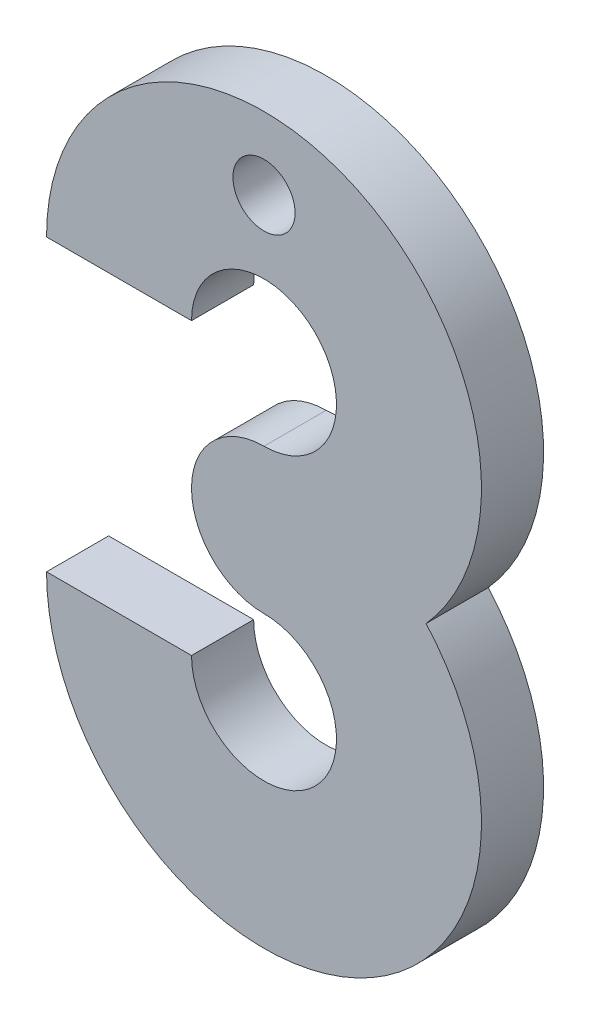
ISO-10303-21;
HEADER;
FILE_DESCRIPTION(('STEP AP214'),'2;1');
FILE_NAME('part.step','',(''),(''),'','','');
FILE_SCHEMA(('AUTOMOTIVE_DESIGN { 1 0 10303 214 1 1 1 1 }'));
ENDSEC;
DATA;
#1=APPLICATION_CONTEXT('core data for automotive mechanical design processes');
#2=APPLICATION_PROTOCOL_DEFINITION('international standard','automotive_design',2000,#1);
#3=PRODUCT_CONTEXT('',#1,'mechanical');
#4=PRODUCT('Part','Part','',(#3));
#5=PRODUCT_RELATED_PRODUCT_CATEGORY('part','',(#4));
#6=PRODUCT_DEFINITION_FORMATION('','',#4);
#7=PRODUCT_DEFINITION_CONTEXT('part definition',#1,'design');
#8=PRODUCT_DEFINITION('design','',#6,#7);
#9=PRODUCT_DEFINITION_SHAPE('','',#8);
#10=(LENGTH_UNIT() NAMED_UNIT(*) SI_UNIT(.MILLI.,.METRE.));
#11=(NAMED_UNIT(*) PLANE_ANGLE_UNIT() SI_UNIT($,.RADIAN.));
#12=(NAMED_UNIT(*) SI_UNIT($,.STERADIAN.) SOLID_ANGLE_UNIT());
#13=UNCERTAINTY_MEASURE_WITH_UNIT(LENGTH_MEASURE(1.E-05),#10,'distance_accuracy_value','');
#14=(GEOMETRIC_REPRESENTATION_CONTEXT(3) GLOBAL_UNCERTAINTY_ASSIGNED_CONTEXT((#13)) GLOBAL_UNIT_ASSIGNED_CONTEXT((#10,
#11,#12)) REPRESENTATION_CONTEXT('',''));
#15=CARTESIAN_POINT('',(0.,0.,0.));
#16=DIRECTION('',(0.,0.,1.));
#17=DIRECTION('',(1.,0.,0.));
#18=AXIS2_PLACEMENT_3D('',#15,#16,#17);
#19=CARTESIAN_POINT('',(21.,35.,6.));
#20=DIRECTION('',(0.,0.,1.));
#21=DIRECTION('',(1.,0.,0.));
#22=AXIS2_PLACEMENT_3D('',#19,#20,#21);
#23=PLANE('',#22);
#24=CARTESIAN_POINT('',(21.,35.,6.));
#25=DIRECTION('',(0.,0.,1.));
#26=DIRECTION('',(1.,0.,0.));
#27=AXIS2_PLACEMENT_3D('',#24,#25,#26);
#28=CIRCLE('',#27,7.);
#29=CARTESIAN_POINT('',(21.,42.,6.));
#30=VERTEX_POINT('',#29);
#31=CARTESIAN_POINT('',(21.,28.,6.));
#32=VERTEX_POINT('',#31);
#33=EDGE_CURVE('E137',#30,#32,#28,.T.);
#34=ORIENTED_EDGE('',*,*,#33,.T.);
#35=CARTESIAN_POINT('',(21.,21.,6.));
#36=DIRECTION('',(0.,0.,-1.));
#37=DIRECTION('',(1.,0.,0.));
#38=AXIS2_PLACEMENT_3D('',#35,#36,#37);
#39=CIRCLE('',#38,7.);
#40=CARTESIAN_POINT('',(14.,21.,6.));
#41=VERTEX_POINT('',#40);
#42=EDGE_CURVE('E90',#32,#41,#39,.T.);
#43=ORIENTED_EDGE('',*,*,#42,.T.);
#44=DIRECTION('',(-1.,0.,0.));
#45=VECTOR('',#44,1.);
#46=CARTESIAN_POINT('',(14.,21.,6.));
#47=LINE('',#46,#45);
#48=CARTESIAN_POINT('',(0.,20.9999999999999,6.));
#49=VERTEX_POINT('',#48);
#50=EDGE_CURVE('E149',#41,#49,#47,.T.);
#51=ORIENTED_EDGE('',*,*,#50,.T.);
#52=CARTESIAN_POINT('',(21.,21.,6.));
#53=DIRECTION('',(0.,0.,1.));
#54=DIRECTION('',(1.,0.,0.));
#55=AXIS2_PLACEMENT_3D('',#52,#53,#54);
#56=CIRCLE('',#55,21.);
#57=CARTESIAN_POINT('',(36.6524758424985,35.,6.));
#58=VERTEX_POINT('',#57);
#59=EDGE_CURVE('E106',#49,#58,#56,.T.);
#60=ORIENTED_EDGE('',*,*,#59,.T.);
#61=CARTESIAN_POINT('',(21.,49.,6.));
#62=DIRECTION('',(0.,0.,1.));
#63=DIRECTION('',(1.,0.,0.));
#64=AXIS2_PLACEMENT_3D('',#61,#62,#63);
#65=CIRCLE('',#64,21.);
#66=CARTESIAN_POINT('',(0.,48.9999999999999,6.));
#67=VERTEX_POINT('',#66);
#68=EDGE_CURVE('E100',#58,#67,#65,.T.);
#69=ORIENTED_EDGE('',*,*,#68,.T.);
#70=DIRECTION('',(1.,0.,0.));
#71=VECTOR('',#70,1.);
#72=CARTESIAN_POINT('',(14.,49.,6.));
#73=LINE('',#72,#71);
#74=CARTESIAN_POINT('',(14.,49.,6.));
#75=VERTEX_POINT('',#74);
#76=EDGE_CURVE('E104',#67,#75,#73,.T.);
#77=ORIENTED_EDGE('',*,*,#76,.T.);
#78=CARTESIAN_POINT('',(21.,49.,6.));
#79=DIRECTION('',(0.,0.,-1.));
#80=DIRECTION('',(1.,0.,0.));
#81=AXIS2_PLACEMENT_3D('',#78,#79,#80);
#82=CIRCLE('',#81,6.99999999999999);
#83=EDGE_CURVE('E50',#75,#30,#82,.T.);
#84=ORIENTED_EDGE('',*,*,#83,.T.);
#85=EDGE_LOOP('',(#34,#43,#51,#60,#69,#77,#84));
#86=FACE_BOUND('',#85,.T.);
#87=CARTESIAN_POINT('',(20.9999999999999,63.,6.));
#88=DIRECTION('',(0.,0.,1.));
#89=DIRECTION('',(1.,0.,0.));
#90=AXIS2_PLACEMENT_3D('',#87,#88,#89);
#91=CIRCLE('',#90,3.);
#92=CARTESIAN_POINT('',(23.9999999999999,63.,6.));
#93=VERTEX_POINT('',#92);
#94=EDGE_CURVE('E128',#93,#93,#91,.T.);
#95=ORIENTED_EDGE('',*,*,#94,.F.);
#96=EDGE_LOOP('',(#95));
#97=FACE_BOUND('',#96,.T.);
#98=ADVANCED_FACE('F33',(#86,#97),#23,.T.);
#99=CARTESIAN_POINT('',(21.,35.,0.));
#100=DIRECTION('',(0.,0.,1.));
#101=DIRECTION('',(1.,0.,0.));
#102=AXIS2_PLACEMENT_3D('',#99,#100,#101);
#103=PLANE('',#102);
#104=CARTESIAN_POINT('',(21.,35.,0.));
#105=DIRECTION('',(0.,0.,1.));
#106=DIRECTION('',(1.,0.,0.));
#107=AXIS2_PLACEMENT_3D('',#104,#105,#106);
#108=CIRCLE('',#107,7.);
#109=CARTESIAN_POINT('',(21.,42.,0.));
#110=VERTEX_POINT('',#109);
#111=CARTESIAN_POINT('',(21.,28.,0.));
#112=VERTEX_POINT('',#111);
#113=EDGE_CURVE('E124',#110,#112,#108,.T.);
#114=ORIENTED_EDGE('',*,*,#113,.F.);
#115=CARTESIAN_POINT('',(21.,49.,0.));
#116=DIRECTION('',(0.,0.,-1.));
#117=DIRECTION('',(1.,0.,0.));
#118=AXIS2_PLACEMENT_3D('',#115,#116,#117);
#119=CIRCLE('',#118,6.99999999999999);
#120=CARTESIAN_POINT('',(14.,49.,0.));
#121=VERTEX_POINT('',#120);
#122=EDGE_CURVE('E82',#121,#110,#119,.T.);
#123=ORIENTED_EDGE('',*,*,#122,.F.);
#124=DIRECTION('',(1.,0.,0.));
#125=VECTOR('',#124,1.);
#126=CARTESIAN_POINT('',(14.,49.,0.));
#127=LINE('',#126,#125);
#128=CARTESIAN_POINT('',(0.,48.9999999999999,0.));
#129=VERTEX_POINT('',#128);
#130=EDGE_CURVE('E76',#129,#121,#127,.T.);
#131=ORIENTED_EDGE('',*,*,#130,.F.);
#132=CARTESIAN_POINT('',(21.,49.,0.));
#133=DIRECTION('',(0.,0.,1.));
#134=DIRECTION('',(1.,0.,0.));
#135=AXIS2_PLACEMENT_3D('',#132,#133,#134);
#136=CIRCLE('',#135,21.);
#137=CARTESIAN_POINT('',(36.6524758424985,35.,0.));
#138=VERTEX_POINT('',#137);
#139=EDGE_CURVE('E114',#138,#129,#136,.T.);
#140=ORIENTED_EDGE('',*,*,#139,.F.);
#141=CARTESIAN_POINT('',(21.,21.,0.));
#142=DIRECTION('',(0.,0.,1.));
#143=DIRECTION('',(1.,0.,0.));
#144=AXIS2_PLACEMENT_3D('',#141,#142,#143);
#145=CIRCLE('',#144,21.);
#146=CARTESIAN_POINT('',(0.,20.9999999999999,0.));
#147=VERTEX_POINT('',#146);
#148=EDGE_CURVE('E132',#147,#138,#145,.T.);
#149=ORIENTED_EDGE('',*,*,#148,.F.);
#150=DIRECTION('',(-1.,0.,0.));
#151=VECTOR('',#150,1.);
#152=CARTESIAN_POINT('',(14.,21.,0.));
#153=LINE('',#152,#151);
#154=CARTESIAN_POINT('',(14.,21.,0.));
#155=VERTEX_POINT('',#154);
#156=EDGE_CURVE('E130',#155,#147,#153,.T.);
#157=ORIENTED_EDGE('',*,*,#156,.F.);
#158=CARTESIAN_POINT('',(21.,21.,0.));
#159=DIRECTION('',(0.,0.,-1.));
#160=DIRECTION('',(1.,0.,0.));
#161=AXIS2_PLACEMENT_3D('',#158,#159,#160);
#162=CIRCLE('',#161,7.);
#163=EDGE_CURVE('E127',#112,#155,#162,.T.);
#164=ORIENTED_EDGE('',*,*,#163,.F.);
#165=EDGE_LOOP('',(#114,#123,#131,#140,#149,#157,#164));
#166=FACE_BOUND('',#165,.T.);
#167=CARTESIAN_POINT('',(20.9999999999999,63.,0.));
#168=DIRECTION('',(0.,0.,1.));
#169=DIRECTION('',(1.,0.,0.));
#170=AXIS2_PLACEMENT_3D('',#167,#168,#169);
#171=CIRCLE('',#170,3.);
#172=CARTESIAN_POINT('',(23.9999999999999,63.,0.));
#173=VERTEX_POINT('',#172);
#174=EDGE_CURVE('E161',#173,#173,#171,.T.);
#175=ORIENTED_EDGE('',*,*,#174,.T.);
#176=EDGE_LOOP('',(#175));
#177=FACE_BOUND('',#176,.T.);
#178=ADVANCED_FACE('F153',(#166,#177),#103,.F.);
#179=CARTESIAN_POINT('',(21.,35.,6.));
#180=DIRECTION('',(0.,0.,-1.));
#181=DIRECTION('',(-1.,0.,0.));
#182=AXIS2_PLACEMENT_3D('',#179,#180,#181);
#183=CYLINDRICAL_SURFACE('',#182,7.);
#184=ORIENTED_EDGE('',*,*,#113,.T.);
#185=DIRECTION('',(0.,0.,-1.));
#186=VECTOR('',#185,1.);
#187=CARTESIAN_POINT('',(21.,28.,6.));
#188=LINE('',#187,#186);
#189=EDGE_CURVE('E11',#32,#112,#188,.T.);
#190=ORIENTED_EDGE('',*,*,#189,.F.);
#191=ORIENTED_EDGE('',*,*,#33,.F.);
#192=DIRECTION('',(0.,0.,-1.));
#193=VECTOR('',#192,1.);
#194=CARTESIAN_POINT('',(21.,42.,6.));
#195=LINE('',#194,#193);
#196=EDGE_CURVE('E120',#30,#110,#195,.T.);
#197=ORIENTED_EDGE('',*,*,#196,.T.);
#198=EDGE_LOOP('',(#184,#190,#191,#197));
#199=FACE_BOUND('',#198,.T.);
#200=ADVANCED_FACE('F35',(#199),#183,.T.);
#201=CARTESIAN_POINT('',(21.,21.,6.));
#202=DIRECTION('',(0.,0.,-1.));
#203=DIRECTION('',(-1.,0.,0.));
#204=AXIS2_PLACEMENT_3D('',#201,#202,#203);
#205=CYLINDRICAL_SURFACE('',#204,7.);
#206=ORIENTED_EDGE('',*,*,#163,.T.);
#207=DIRECTION('',(0.,0.,-1.));
#208=VECTOR('',#207,1.);
#209=CARTESIAN_POINT('',(14.,21.,6.));
#210=LINE('',#209,#208);
#211=EDGE_CURVE('E42',#41,#155,#210,.T.);
#212=ORIENTED_EDGE('',*,*,#211,.F.);
#213=ORIENTED_EDGE('',*,*,#42,.F.);
#214=ORIENTED_EDGE('',*,*,#189,.T.);
#215=EDGE_LOOP('',(#206,#212,#213,#214));
#216=FACE_BOUND('',#215,.T.);
#217=ADVANCED_FACE('F187',(#216),#205,.F.);
#218=CARTESIAN_POINT('',(14.,21.,6.));
#219=DIRECTION('',(0.,-1.,0.));
#220=DIRECTION('',(1.,0.,0.));
#221=AXIS2_PLACEMENT_3D('',#218,#219,#220);
#222=PLANE('',#221);
#223=ORIENTED_EDGE('',*,*,#156,.T.);
#224=DIRECTION('',(0.,0.,-1.));
#225=VECTOR('',#224,1.);
#226=CARTESIAN_POINT('',(0.,20.9999999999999,6.));
#227=LINE('',#226,#225);
#228=EDGE_CURVE('E141',#49,#147,#227,.T.);
#229=ORIENTED_EDGE('',*,*,#228,.F.);
#230=ORIENTED_EDGE('',*,*,#50,.F.);
#231=ORIENTED_EDGE('',*,*,#211,.T.);
#232=EDGE_LOOP('',(#223,#229,#230,#231));
#233=FACE_BOUND('',#232,.T.);
#234=ADVANCED_FACE('F147',(#233),#222,.F.);
#235=CARTESIAN_POINT('',(21.,21.,6.));
#236=DIRECTION('',(0.,0.,-1.));
#237=DIRECTION('',(-1.,0.,0.));
#238=AXIS2_PLACEMENT_3D('',#235,#236,#237);
#239=CYLINDRICAL_SURFACE('',#238,21.);
#240=ORIENTED_EDGE('',*,*,#148,.T.);
#241=DIRECTION('',(0.,0.,-1.));
#242=VECTOR('',#241,1.);
#243=CARTESIAN_POINT('',(36.6524758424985,35.,6.));
#244=LINE('',#243,#242);
#245=EDGE_CURVE('E115',#58,#138,#244,.T.);
#246=ORIENTED_EDGE('',*,*,#245,.F.);
#247=ORIENTED_EDGE('',*,*,#59,.F.);
#248=ORIENTED_EDGE('',*,*,#228,.T.);
#249=EDGE_LOOP('',(#240,#246,#247,#248));
#250=FACE_BOUND('',#249,.T.);
#251=ADVANCED_FACE('F156',(#250),#239,.T.);
#252=CARTESIAN_POINT('',(21.,49.,6.));
#253=DIRECTION('',(0.,0.,-1.));
#254=DIRECTION('',(-1.,0.,0.));
#255=AXIS2_PLACEMENT_3D('',#252,#253,#254);
#256=CYLINDRICAL_SURFACE('',#255,21.);
#257=ORIENTED_EDGE('',*,*,#139,.T.);
#258=DIRECTION('',(0.,0.,-1.));
#259=VECTOR('',#258,1.);
#260=CARTESIAN_POINT('',(0.,48.9999999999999,6.));
#261=LINE('',#260,#259);
#262=EDGE_CURVE('E111',#67,#129,#261,.T.);
#263=ORIENTED_EDGE('',*,*,#262,.F.);
#264=ORIENTED_EDGE('',*,*,#68,.F.);
#265=ORIENTED_EDGE('',*,*,#245,.T.);
#266=EDGE_LOOP('',(#257,#263,#264,#265));
#267=FACE_BOUND('',#266,.T.);
#268=ADVANCED_FACE('F112',(#267),#256,.T.);
#269=CARTESIAN_POINT('',(14.,49.,6.));
#270=DIRECTION('',(0.,1.,0.));
#271=DIRECTION('',(-1.,0.,0.));
#272=AXIS2_PLACEMENT_3D('',#269,#270,#271);
#273=PLANE('',#272);
#274=ORIENTED_EDGE('',*,*,#130,.T.);
#275=DIRECTION('',(0.,0.,-1.));
#276=VECTOR('',#275,1.);
#277=CARTESIAN_POINT('',(14.,49.,6.));
#278=LINE('',#277,#276);
#279=EDGE_CURVE('E116',#75,#121,#278,.T.);
#280=ORIENTED_EDGE('',*,*,#279,.F.);
#281=ORIENTED_EDGE('',*,*,#76,.F.);
#282=ORIENTED_EDGE('',*,*,#262,.T.);
#283=EDGE_LOOP('',(#274,#280,#281,#282));
#284=FACE_BOUND('',#283,.T.);
#285=ADVANCED_FACE('F118',(#284),#273,.F.);
#286=CARTESIAN_POINT('',(21.,49.,6.));
#287=DIRECTION('',(0.,0.,-1.));
#288=DIRECTION('',(-1.,0.,0.));
#289=AXIS2_PLACEMENT_3D('',#286,#287,#288);
#290=CYLINDRICAL_SURFACE('',#289,6.99999999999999);
#291=ORIENTED_EDGE('',*,*,#122,.T.);
#292=ORIENTED_EDGE('',*,*,#196,.F.);
#293=ORIENTED_EDGE('',*,*,#83,.F.);
#294=ORIENTED_EDGE('',*,*,#279,.T.);
#295=EDGE_LOOP('',(#291,#292,#293,#294));
#296=FACE_BOUND('',#295,.T.);
#297=ADVANCED_FACE('F177',(#296),#290,.F.);
#298=CARTESIAN_POINT('',(20.9999999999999,63.,6.));
#299=DIRECTION('',(0.,0.,-1.));
#300=DIRECTION('',(-1.,0.,0.));
#301=AXIS2_PLACEMENT_3D('',#298,#299,#300);
#302=CYLINDRICAL_SURFACE('',#301,3.);
#303=ORIENTED_EDGE('',*,*,#94,.T.);
#304=EDGE_LOOP('',(#303));
#305=FACE_BOUND('',#304,.T.);
#306=ORIENTED_EDGE('',*,*,#174,.F.);
#307=EDGE_LOOP('',(#306));
#308=FACE_BOUND('',#307,.T.);
#309=ADVANCED_FACE('F167',(#305,#308),#302,.F.);
#310=CLOSED_SHELL('',(#98,#178,#200,#217,#234,#251,#268,#285,#297,#309));
#311=MANIFOLD_SOLID_BREP('B2',#310);
#312=ADVANCED_BREP_SHAPE_REPRESENTATION('',(#18,#311),#14);
#313=SHAPE_DEFINITION_REPRESENTATION(#9,#312);
ENDSEC;
END-ISO-10303-21;
